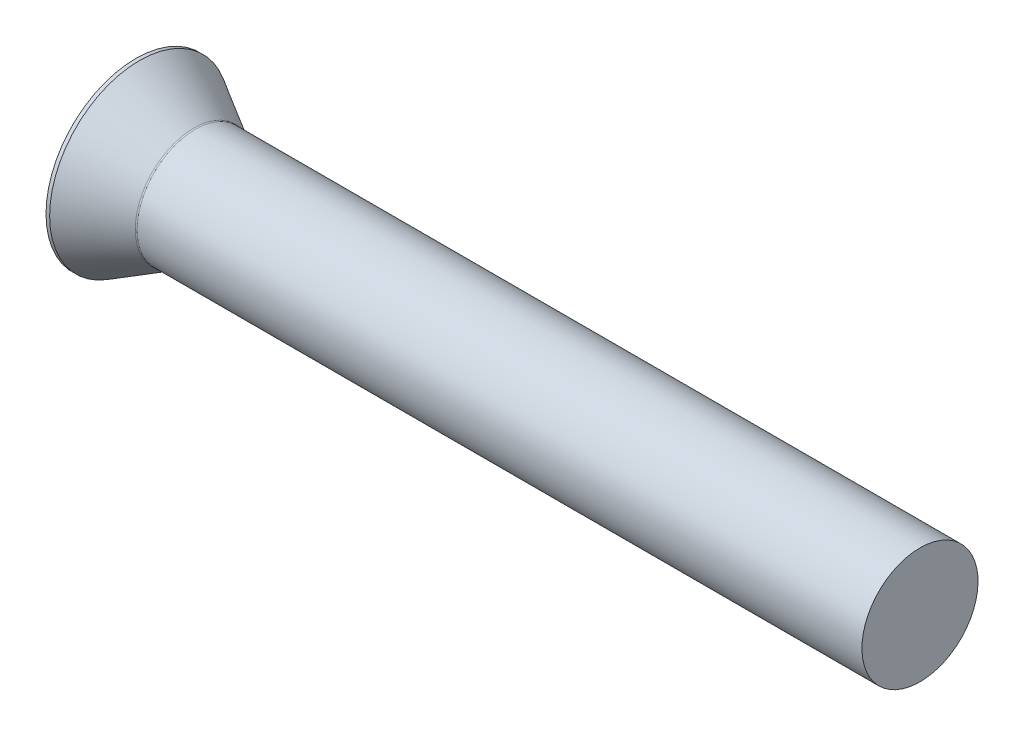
ISO-10303-21;
HEADER;
FILE_DESCRIPTION(('STEP AP214'),'2;1');
FILE_NAME('part.step','',(''),(''),'','','');
FILE_SCHEMA(('AUTOMOTIVE_DESIGN { 1 0 10303 214 1 1 1 1 }'));
ENDSEC;
DATA;
#1=APPLICATION_CONTEXT('core data for automotive mechanical design processes');
#2=APPLICATION_PROTOCOL_DEFINITION('international standard','automotive_design',2000,#1);
#3=PRODUCT_CONTEXT('',#1,'mechanical');
#4=PRODUCT('Part','Part','',(#3));
#5=PRODUCT_RELATED_PRODUCT_CATEGORY('part','',(#4));
#6=PRODUCT_DEFINITION_FORMATION('','',#4);
#7=PRODUCT_DEFINITION_CONTEXT('part definition',#1,'design');
#8=PRODUCT_DEFINITION('design','',#6,#7);
#9=PRODUCT_DEFINITION_SHAPE('','',#8);
#10=(LENGTH_UNIT() NAMED_UNIT(*) SI_UNIT(.MILLI.,.METRE.));
#11=(NAMED_UNIT(*) PLANE_ANGLE_UNIT() SI_UNIT($,.RADIAN.));
#12=(NAMED_UNIT(*) SI_UNIT($,.STERADIAN.) SOLID_ANGLE_UNIT());
#13=UNCERTAINTY_MEASURE_WITH_UNIT(LENGTH_MEASURE(1.E-05),#10,'distance_accuracy_value','');
#14=(GEOMETRIC_REPRESENTATION_CONTEXT(3) GLOBAL_UNCERTAINTY_ASSIGNED_CONTEXT((#13)) GLOBAL_UNIT_ASSIGNED_CONTEXT((#10,
#11,#12)) REPRESENTATION_CONTEXT('',''));
#15=CARTESIAN_POINT('',(0.,0.,0.));
#16=DIRECTION('',(0.,0.,1.));
#17=DIRECTION('',(1.,0.,0.));
#18=AXIS2_PLACEMENT_3D('',#15,#16,#17);
#19=CARTESIAN_POINT('',(11.4,0.,0.));
#20=DIRECTION('',(-1.,0.,0.));
#21=DIRECTION('',(0.,0.,1.));
#22=AXIS2_PLACEMENT_3D('',#19,#20,#21);
#23=CONICAL_SURFACE('',#22,8.,0.523598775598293);
#24=CARTESIAN_POINT('',(11.3071796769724,0.,0.));
#25=DIRECTION('',(-1.,0.,0.));
#26=DIRECTION('',(0.,0.,1.));
#27=AXIS2_PLACEMENT_3D('',#24,#25,#26);
#28=CIRCLE('',#27,8.05358983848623);
#29=CARTESIAN_POINT('',(11.3071796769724,0.,8.05358983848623));
#30=VERTEX_POINT('',#29);
#31=EDGE_CURVE('E10',#30,#30,#28,.T.);
#32=ORIENTED_EDGE('',*,*,#31,.T.);
#33=EDGE_LOOP('',(#32));
#34=FACE_BOUND('',#33,.T.);
#35=CARTESIAN_POINT('',(3.82328808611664,0.,0.));
#36=DIRECTION('',(-1.,0.,0.));
#37=DIRECTION('',(0.,0.,1.));
#38=AXIS2_PLACEMENT_3D('',#35,#36,#37);
#39=CIRCLE('',#38,12.3744166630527);
#40=CARTESIAN_POINT('',(3.82328808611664,0.,12.3744166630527));
#41=VERTEX_POINT('',#40);
#42=EDGE_CURVE('E48',#41,#41,#39,.T.);
#43=ORIENTED_EDGE('',*,*,#42,.F.);
#44=EDGE_LOOP('',(#43));
#45=FACE_BOUND('',#44,.T.);
#46=ADVANCED_FACE('F40',(#34,#45),#23,.T.);
#47=CARTESIAN_POINT('',(-11.0212505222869,0.,0.));
#48=DIRECTION('',(-1.,0.,0.));
#49=DIRECTION('',(0.,0.,1.));
#50=AXIS2_PLACEMENT_3D('',#47,#48,#49);
#51=CYLINDRICAL_SURFACE('',#50,12.3744166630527);
#52=CARTESIAN_POINT('',(3.32328808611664,0.,0.));
#53=DIRECTION('',(-1.,0.,0.));
#54=DIRECTION('',(0.,0.,1.));
#55=AXIS2_PLACEMENT_3D('',#52,#53,#54);
#56=CIRCLE('',#55,12.3744166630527);
#57=CARTESIAN_POINT('',(3.32328808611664,0.,12.3744166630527));
#58=VERTEX_POINT('',#57);
#59=EDGE_CURVE('E55',#58,#58,#56,.T.);
#60=ORIENTED_EDGE('',*,*,#59,.F.);
#61=EDGE_LOOP('',(#60));
#62=FACE_BOUND('',#61,.T.);
#63=ORIENTED_EDGE('',*,*,#42,.T.);
#64=EDGE_LOOP('',(#63));
#65=FACE_BOUND('',#64,.T.);
#66=ADVANCED_FACE('F72',(#62,#65),#51,.T.);
#67=CARTESIAN_POINT('',(24.7,0.,0.));
#68=DIRECTION('',(-1.,0.,0.));
#69=DIRECTION('',(0.,1.,0.));
#70=AXIS2_PLACEMENT_3D('',#67,#68,#69);
#71=SPHERICAL_SURFACE('',#70,24.7);
#72=ORIENTED_EDGE('',*,*,#59,.T.);
#73=EDGE_LOOP('',(#72));
#74=FACE_BOUND('',#73,.T.);
#75=ADVANCED_FACE('F65',(#74),#71,.T.);
#76=CARTESIAN_POINT('',(111.399999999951,0.,0.));
#77=DIRECTION('',(-1.,0.,0.));
#78=DIRECTION('',(0.,-1.,0.));
#79=AXIS2_PLACEMENT_3D('',#76,#77,#78);
#80=CYLINDRICAL_SURFACE('',#79,8.);
#81=CARTESIAN_POINT('',(11.5071796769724,0.,0.));
#82=DIRECTION('',(1.,0.,0.));
#83=DIRECTION('',(0.,1.,0.));
#84=AXIS2_PLACEMENT_3D('',#81,#82,#83);
#85=CIRCLE('',#84,8.);
#86=CARTESIAN_POINT('',(11.5071796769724,8.,0.));
#87=VERTEX_POINT('',#86);
#88=EDGE_CURVE('E42',#87,#87,#85,.T.);
#89=ORIENTED_EDGE('',*,*,#88,.T.);
#90=EDGE_LOOP('',(#89));
#91=FACE_BOUND('',#90,.T.);
#92=CARTESIAN_POINT('',(111.399999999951,0.,0.));
#93=DIRECTION('',(1.,0.,0.));
#94=DIRECTION('',(0.,1.,0.));
#95=AXIS2_PLACEMENT_3D('',#92,#93,#94);
#96=CIRCLE('',#95,8.);
#97=CARTESIAN_POINT('',(111.399999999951,8.00000000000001,0.));
#98=VERTEX_POINT('',#97);
#99=EDGE_CURVE('E60',#98,#98,#96,.T.);
#100=ORIENTED_EDGE('',*,*,#99,.F.);
#101=EDGE_LOOP('',(#100));
#102=FACE_BOUND('',#101,.T.);
#103=ADVANCED_FACE('F64',(#91,#102),#80,.T.);
#104=CARTESIAN_POINT('',(111.399999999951,0.,0.));
#105=DIRECTION('',(1.,0.,0.));
#106=DIRECTION('',(0.,1.,0.));
#107=AXIS2_PLACEMENT_3D('',#104,#105,#106);
#108=PLANE('',#107);
#109=ORIENTED_EDGE('',*,*,#99,.T.);
#110=EDGE_LOOP('',(#109));
#111=FACE_BOUND('',#110,.T.);
#112=ADVANCED_FACE('F61',(#111),#108,.T.);
#113=CARTESIAN_POINT('',(11.5071796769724,0.,0.));
#114=DIRECTION('',(1.,0.,0.));
#115=DIRECTION('',(0.,1.,0.));
#116=AXIS2_PLACEMENT_3D('',#113,#114,#115);
#117=TOROIDAL_SURFACE('',#116,8.4,0.4);
#118=ORIENTED_EDGE('',*,*,#31,.F.);
#119=EDGE_LOOP('',(#118));
#120=FACE_BOUND('',#119,.T.);
#121=ORIENTED_EDGE('',*,*,#88,.F.);
#122=EDGE_LOOP('',(#121));
#123=FACE_BOUND('',#122,.T.);
#124=ADVANCED_FACE('F39',(#120,#123),#117,.F.);
#125=CLOSED_SHELL('',(#46,#66,#75,#103,#112,#124));
#126=MANIFOLD_SOLID_BREP('B2',#125);
#127=ADVANCED_BREP_SHAPE_REPRESENTATION('',(#18,#126),#14);
#128=SHAPE_DEFINITION_REPRESENTATION(#9,#127);
ENDSEC;
END-ISO-10303-21;
